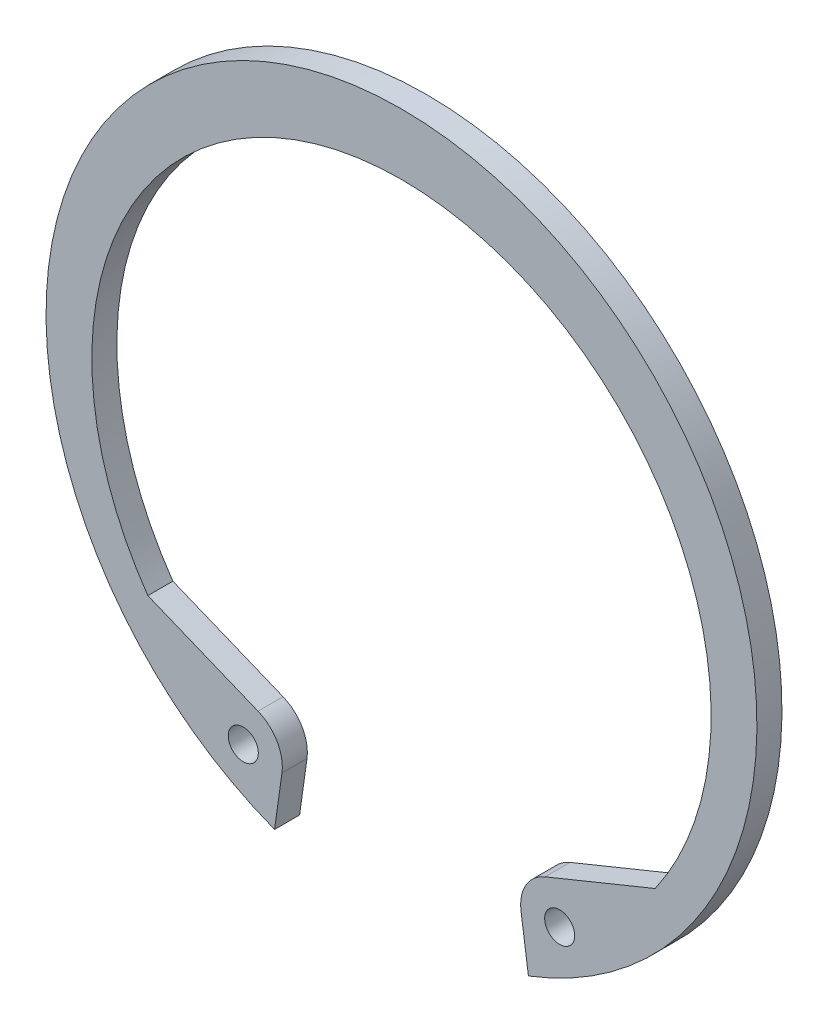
ISO-10303-21;
HEADER;
FILE_DESCRIPTION(('STEP AP214'),'2;1');
FILE_NAME('part.step','',(''),(''),'','','');
FILE_SCHEMA(('AUTOMOTIVE_DESIGN { 1 0 10303 214 1 1 1 1 }'));
ENDSEC;
DATA;
#1=APPLICATION_CONTEXT('core data for automotive mechanical design processes');
#2=APPLICATION_PROTOCOL_DEFINITION('international standard','automotive_design',2000,#1);
#3=PRODUCT_CONTEXT('',#1,'mechanical');
#4=PRODUCT('Part','Part','',(#3));
#5=PRODUCT_RELATED_PRODUCT_CATEGORY('part','',(#4));
#6=PRODUCT_DEFINITION_FORMATION('','',#4);
#7=PRODUCT_DEFINITION_CONTEXT('part definition',#1,'design');
#8=PRODUCT_DEFINITION('design','',#6,#7);
#9=PRODUCT_DEFINITION_SHAPE('','',#8);
#10=(LENGTH_UNIT() NAMED_UNIT(*) SI_UNIT(.MILLI.,.METRE.));
#11=(NAMED_UNIT(*) PLANE_ANGLE_UNIT() SI_UNIT($,.RADIAN.));
#12=(NAMED_UNIT(*) SI_UNIT($,.STERADIAN.) SOLID_ANGLE_UNIT());
#13=UNCERTAINTY_MEASURE_WITH_UNIT(LENGTH_MEASURE(1.E-05),#10,'distance_accuracy_value','');
#14=(GEOMETRIC_REPRESENTATION_CONTEXT(3) GLOBAL_UNCERTAINTY_ASSIGNED_CONTEXT((#13)) GLOBAL_UNIT_ASSIGNED_CONTEXT((#10,
#11,#12)) REPRESENTATION_CONTEXT('',''));
#15=CARTESIAN_POINT('',(0.,0.,0.));
#16=DIRECTION('',(0.,0.,1.));
#17=DIRECTION('',(1.,0.,0.));
#18=AXIS2_PLACEMENT_3D('',#15,#16,#17);
#19=CARTESIAN_POINT('',(-14.3260695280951,-23.7556509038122,2.5));
#20=DIRECTION('',(-0.37793089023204,-0.925833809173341,0.));
#21=DIRECTION('',(0.925833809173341,-0.37793089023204,0.));
#22=AXIS2_PLACEMENT_3D('',#19,#20,#21);
#23=PLANE('',#22);
#24=DIRECTION('',(-0.925833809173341,0.37793089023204,0.));
#25=VECTOR('',#24,1.);
#26=CARTESIAN_POINT('',(-14.3260695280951,-23.7556509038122,0.));
#27=LINE('',#26,#25);
#28=CARTESIAN_POINT('',(-14.3260695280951,-23.7556509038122,0.));
#29=VERTEX_POINT('',#28);
#30=CARTESIAN_POINT('',(-25.3322769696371,-19.2628512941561,0.));
#31=VERTEX_POINT('',#30);
#32=EDGE_CURVE('E111',#29,#31,#27,.T.);
#33=ORIENTED_EDGE('',*,*,#32,.T.);
#34=DIRECTION('',(0.,0.,-1.));
#35=VECTOR('',#34,1.);
#36=CARTESIAN_POINT('',(-25.3322769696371,-19.2628512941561,2.5));
#37=LINE('',#36,#35);
#38=CARTESIAN_POINT('',(-25.3322769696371,-19.2628512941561,2.5));
#39=VERTEX_POINT('',#38);
#40=EDGE_CURVE('E11',#39,#31,#37,.T.);
#41=ORIENTED_EDGE('',*,*,#40,.F.);
#42=DIRECTION('',(-0.925833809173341,0.37793089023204,0.));
#43=VECTOR('',#42,1.);
#44=CARTESIAN_POINT('',(-14.3260695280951,-23.7556509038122,2.5));
#45=LINE('',#44,#43);
#46=CARTESIAN_POINT('',(-14.3260695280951,-23.7556509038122,2.5));
#47=VERTEX_POINT('',#46);
#48=EDGE_CURVE('E131',#47,#39,#45,.T.);
#49=ORIENTED_EDGE('',*,*,#48,.F.);
#50=DIRECTION('',(0.,0.,-1.));
#51=VECTOR('',#50,1.);
#52=CARTESIAN_POINT('',(-14.3260695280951,-23.7556509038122,2.5));
#53=LINE('',#52,#51);
#54=EDGE_CURVE('E146',#47,#29,#53,.T.);
#55=ORIENTED_EDGE('',*,*,#54,.T.);
#56=EDGE_LOOP('',(#33,#41,#49,#55));
#57=FACE_BOUND('',#56,.T.);
#58=ADVANCED_FACE('F30',(#57),#23,.F.);
#59=CARTESIAN_POINT('',(0.,-1.525,2.5));
#60=DIRECTION('',(0.,0.,-1.));
#61=DIRECTION('',(-1.,0.,0.));
#62=AXIS2_PLACEMENT_3D('',#59,#60,#61);
#63=CYLINDRICAL_SURFACE('',#62,30.925);
#64=CARTESIAN_POINT('',(0.,-1.525,0.));
#65=DIRECTION('',(0.,0.,1.));
#66=DIRECTION('',(1.,0.,0.));
#67=AXIS2_PLACEMENT_3D('',#64,#65,#66);
#68=CIRCLE('',#67,30.925);
#69=CARTESIAN_POINT('',(25.3322769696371,-19.2628512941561,0.));
#70=VERTEX_POINT('',#69);
#71=EDGE_CURVE('E105',#70,#31,#68,.T.);
#72=ORIENTED_EDGE('',*,*,#71,.F.);
#73=DIRECTION('',(0.,0.,-1.));
#74=VECTOR('',#73,1.);
#75=CARTESIAN_POINT('',(25.3322769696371,-19.2628512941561,2.5));
#76=LINE('',#75,#74);
#77=CARTESIAN_POINT('',(25.3322769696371,-19.2628512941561,2.5));
#78=VERTEX_POINT('',#77);
#79=EDGE_CURVE('E33',#78,#70,#76,.T.);
#80=ORIENTED_EDGE('',*,*,#79,.F.);
#81=CARTESIAN_POINT('',(0.,-1.525,2.5));
#82=DIRECTION('',(0.,0.,1.));
#83=DIRECTION('',(1.,0.,0.));
#84=AXIS2_PLACEMENT_3D('',#81,#82,#83);
#85=CIRCLE('',#84,30.925);
#86=EDGE_CURVE('E134',#78,#39,#85,.T.);
#87=ORIENTED_EDGE('',*,*,#86,.T.);
#88=ORIENTED_EDGE('',*,*,#40,.T.);
#89=EDGE_LOOP('',(#72,#80,#87,#88));
#90=FACE_BOUND('',#89,.T.);
#91=ADVANCED_FACE('F106',(#90),#63,.F.);
#92=CARTESIAN_POINT('',(14.326069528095,-23.7556509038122,2.5));
#93=DIRECTION('',(-0.377930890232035,0.925833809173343,0.));
#94=DIRECTION('',(-0.925833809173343,-0.377930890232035,0.));
#95=AXIS2_PLACEMENT_3D('',#92,#93,#94);
#96=PLANE('',#95);
#97=DIRECTION('',(0.925833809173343,0.377930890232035,0.));
#98=VECTOR('',#97,1.);
#99=CARTESIAN_POINT('',(14.326069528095,-23.7556509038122,0.));
#100=LINE('',#99,#98);
#101=CARTESIAN_POINT('',(14.326069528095,-23.7556509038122,0.));
#102=VERTEX_POINT('',#101);
#103=EDGE_CURVE('E97',#102,#70,#100,.T.);
#104=ORIENTED_EDGE('',*,*,#103,.F.);
#105=DIRECTION('',(0.,0.,-1.));
#106=VECTOR('',#105,1.);
#107=CARTESIAN_POINT('',(14.326069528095,-23.7556509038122,2.5));
#108=LINE('',#107,#106);
#109=CARTESIAN_POINT('',(14.326069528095,-23.7556509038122,2.5));
#110=VERTEX_POINT('',#109);
#111=EDGE_CURVE('E103',#110,#102,#108,.T.);
#112=ORIENTED_EDGE('',*,*,#111,.F.);
#113=DIRECTION('',(0.925833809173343,0.377930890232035,0.));
#114=VECTOR('',#113,1.);
#115=CARTESIAN_POINT('',(14.326069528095,-23.7556509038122,2.5));
#116=LINE('',#115,#114);
#117=EDGE_CURVE('E99',#110,#78,#116,.T.);
#118=ORIENTED_EDGE('',*,*,#117,.T.);
#119=ORIENTED_EDGE('',*,*,#79,.T.);
#120=EDGE_LOOP('',(#104,#112,#118,#119));
#121=FACE_BOUND('',#120,.T.);
#122=ADVANCED_FACE('F95',(#121),#96,.T.);
#123=CARTESIAN_POINT('',(15.8,-27.3664027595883,2.5));
#124=DIRECTION('',(0.,0.,-1.));
#125=DIRECTION('',(-1.,0.,0.));
#126=AXIS2_PLACEMENT_3D('',#123,#124,#125);
#127=CYLINDRICAL_SURFACE('',#126,3.9);
#128=CARTESIAN_POINT('',(15.8,-27.3664027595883,0.));
#129=DIRECTION('',(0.,0.,1.));
#130=DIRECTION('',(1.,0.,0.));
#131=AXIS2_PLACEMENT_3D('',#128,#129,#130);
#132=CIRCLE('',#131,3.9);
#133=CARTESIAN_POINT('',(11.9379545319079,-27.9091778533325,0.));
#134=VERTEX_POINT('',#133);
#135=EDGE_CURVE('E116',#102,#134,#132,.T.);
#136=ORIENTED_EDGE('',*,*,#135,.T.);
#137=DIRECTION('',(0.,0.,-1.));
#138=VECTOR('',#137,1.);
#139=CARTESIAN_POINT('',(11.9379545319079,-27.9091778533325,2.5));
#140=LINE('',#139,#138);
#141=CARTESIAN_POINT('',(11.9379545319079,-27.9091778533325,2.5));
#142=VERTEX_POINT('',#141);
#143=EDGE_CURVE('E156',#142,#134,#140,.T.);
#144=ORIENTED_EDGE('',*,*,#143,.F.);
#145=CARTESIAN_POINT('',(15.8,-27.3664027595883,2.5));
#146=DIRECTION('',(0.,0.,1.));
#147=DIRECTION('',(1.,0.,0.));
#148=AXIS2_PLACEMENT_3D('',#145,#146,#147);
#149=CIRCLE('',#148,3.9);
#150=EDGE_CURVE('E137',#110,#142,#149,.T.);
#151=ORIENTED_EDGE('',*,*,#150,.F.);
#152=ORIENTED_EDGE('',*,*,#111,.T.);
#153=EDGE_LOOP('',(#136,#144,#151,#152));
#154=FACE_BOUND('',#153,.T.);
#155=ADVANCED_FACE('F161',(#154),#127,.T.);
#156=CARTESIAN_POINT('',(11.9379545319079,-27.9091778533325,2.5));
#157=DIRECTION('',(0.990268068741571,0.139173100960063,0.));
#158=DIRECTION('',(-0.139173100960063,0.990268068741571,0.));
#159=AXIS2_PLACEMENT_3D('',#156,#157,#158);
#160=PLANE('',#159);
#161=DIRECTION('',(0.139173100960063,-0.990268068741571,0.));
#162=VECTOR('',#161,1.);
#163=CARTESIAN_POINT('',(11.9379545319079,-27.9091778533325,0.));
#164=LINE('',#163,#162);
#165=CARTESIAN_POINT('',(12.6758807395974,-33.1597956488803,0.));
#166=VERTEX_POINT('',#165);
#167=EDGE_CURVE('E118',#134,#166,#164,.T.);
#168=ORIENTED_EDGE('',*,*,#167,.T.);
#169=DIRECTION('',(0.,0.,-1.));
#170=VECTOR('',#169,1.);
#171=CARTESIAN_POINT('',(12.6758807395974,-33.1597956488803,2.5));
#172=LINE('',#171,#170);
#173=CARTESIAN_POINT('',(12.6758807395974,-33.1597956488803,2.5));
#174=VERTEX_POINT('',#173);
#175=EDGE_CURVE('E153',#174,#166,#172,.T.);
#176=ORIENTED_EDGE('',*,*,#175,.F.);
#177=DIRECTION('',(0.139173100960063,-0.990268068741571,0.));
#178=VECTOR('',#177,1.);
#179=CARTESIAN_POINT('',(11.9379545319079,-27.9091778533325,2.5));
#180=LINE('',#179,#178);
#181=EDGE_CURVE('E139',#142,#174,#180,.T.);
#182=ORIENTED_EDGE('',*,*,#181,.F.);
#183=ORIENTED_EDGE('',*,*,#143,.T.);
#184=EDGE_LOOP('',(#168,#176,#182,#183));
#185=FACE_BOUND('',#184,.T.);
#186=ADVANCED_FACE('F177',(#185),#160,.F.);
#187=CARTESIAN_POINT('',(0.,0.,2.5));
#188=DIRECTION('',(0.,0.,-1.));
#189=DIRECTION('',(-1.,0.,0.));
#190=AXIS2_PLACEMENT_3D('',#187,#188,#189);
#191=CYLINDRICAL_SURFACE('',#190,35.5);
#192=CARTESIAN_POINT('',(0.,0.,0.));
#193=DIRECTION('',(0.,0.,1.));
#194=DIRECTION('',(1.,0.,0.));
#195=AXIS2_PLACEMENT_3D('',#192,#193,#194);
#196=CIRCLE('',#195,35.5);
#197=CARTESIAN_POINT('',(-12.6758807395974,-33.1597956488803,0.));
#198=VERTEX_POINT('',#197);
#199=EDGE_CURVE('E123',#166,#198,#196,.T.);
#200=ORIENTED_EDGE('',*,*,#199,.T.);
#201=DIRECTION('',(0.,0.,-1.));
#202=VECTOR('',#201,1.);
#203=CARTESIAN_POINT('',(-12.6758807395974,-33.1597956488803,2.5));
#204=LINE('',#203,#202);
#205=CARTESIAN_POINT('',(-12.6758807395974,-33.1597956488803,2.5));
#206=VERTEX_POINT('',#205);
#207=EDGE_CURVE('E151',#206,#198,#204,.T.);
#208=ORIENTED_EDGE('',*,*,#207,.F.);
#209=CARTESIAN_POINT('',(0.,0.,2.5));
#210=DIRECTION('',(0.,0.,1.));
#211=DIRECTION('',(1.,0.,0.));
#212=AXIS2_PLACEMENT_3D('',#209,#210,#211);
#213=CIRCLE('',#212,35.5);
#214=EDGE_CURVE('E141',#174,#206,#213,.T.);
#215=ORIENTED_EDGE('',*,*,#214,.F.);
#216=ORIENTED_EDGE('',*,*,#175,.T.);
#217=EDGE_LOOP('',(#200,#208,#215,#216));
#218=FACE_BOUND('',#217,.T.);
#219=ADVANCED_FACE('F174',(#218),#191,.T.);
#220=CARTESIAN_POINT('',(-11.9379545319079,-27.9091778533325,2.5));
#221=DIRECTION('',(0.99026806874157,-0.139173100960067,0.));
#222=DIRECTION('',(0.139173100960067,0.99026806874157,0.));
#223=AXIS2_PLACEMENT_3D('',#220,#221,#222);
#224=PLANE('',#223);
#225=DIRECTION('',(-0.139173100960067,-0.99026806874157,0.));
#226=VECTOR('',#225,1.);
#227=CARTESIAN_POINT('',(-11.9379545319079,-27.9091778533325,0.));
#228=LINE('',#227,#226);
#229=CARTESIAN_POINT('',(-11.9379545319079,-27.9091778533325,0.));
#230=VERTEX_POINT('',#229);
#231=EDGE_CURVE('E126',#230,#198,#228,.T.);
#232=ORIENTED_EDGE('',*,*,#231,.F.);
#233=DIRECTION('',(0.,0.,-1.));
#234=VECTOR('',#233,1.);
#235=CARTESIAN_POINT('',(-11.9379545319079,-27.9091778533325,2.5));
#236=LINE('',#235,#234);
#237=CARTESIAN_POINT('',(-11.9379545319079,-27.9091778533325,2.5));
#238=VERTEX_POINT('',#237);
#239=EDGE_CURVE('E52',#238,#230,#236,.T.);
#240=ORIENTED_EDGE('',*,*,#239,.F.);
#241=DIRECTION('',(-0.139173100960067,-0.99026806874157,0.));
#242=VECTOR('',#241,1.);
#243=CARTESIAN_POINT('',(-11.9379545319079,-27.9091778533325,2.5));
#244=LINE('',#243,#242);
#245=EDGE_CURVE('E143',#238,#206,#244,.T.);
#246=ORIENTED_EDGE('',*,*,#245,.T.);
#247=ORIENTED_EDGE('',*,*,#207,.T.);
#248=EDGE_LOOP('',(#232,#240,#246,#247));
#249=FACE_BOUND('',#248,.T.);
#250=ADVANCED_FACE('F170',(#249),#224,.T.);
#251=CARTESIAN_POINT('',(-15.8,-27.3664027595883,2.5));
#252=DIRECTION('',(0.,0.,-1.));
#253=DIRECTION('',(-1.,0.,0.));
#254=AXIS2_PLACEMENT_3D('',#251,#252,#253);
#255=CYLINDRICAL_SURFACE('',#254,3.9);
#256=CARTESIAN_POINT('',(-15.8,-27.3664027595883,0.));
#257=DIRECTION('',(0.,0.,1.));
#258=DIRECTION('',(1.,0.,0.));
#259=AXIS2_PLACEMENT_3D('',#256,#257,#258);
#260=CIRCLE('',#259,3.9);
#261=EDGE_CURVE('E129',#230,#29,#260,.T.);
#262=ORIENTED_EDGE('',*,*,#261,.T.);
#263=ORIENTED_EDGE('',*,*,#54,.F.);
#264=CARTESIAN_POINT('',(-15.8,-27.3664027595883,2.5));
#265=DIRECTION('',(0.,0.,1.));
#266=DIRECTION('',(1.,0.,0.));
#267=AXIS2_PLACEMENT_3D('',#264,#265,#266);
#268=CIRCLE('',#267,3.9);
#269=EDGE_CURVE('E44',#238,#47,#268,.T.);
#270=ORIENTED_EDGE('',*,*,#269,.F.);
#271=ORIENTED_EDGE('',*,*,#239,.T.);
#272=EDGE_LOOP('',(#262,#263,#270,#271));
#273=FACE_BOUND('',#272,.T.);
#274=ADVANCED_FACE('F213',(#273),#255,.T.);
#275=CARTESIAN_POINT('',(0.,-1.525,2.5));
#276=DIRECTION('',(0.,0.,1.));
#277=DIRECTION('',(1.,0.,0.));
#278=AXIS2_PLACEMENT_3D('',#275,#276,#277);
#279=PLANE('',#278);
#280=CARTESIAN_POINT('',(15.8,-27.3664027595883,2.5));
#281=DIRECTION('',(0.,0.,-1.));
#282=DIRECTION('',(0.,1.,0.));
#283=AXIS2_PLACEMENT_3D('',#280,#281,#282);
#284=CIRCLE('',#283,1.5);
#285=CARTESIAN_POINT('',(15.8,-25.8664027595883,2.5));
#286=VERTEX_POINT('',#285);
#287=EDGE_CURVE('E254',#286,#286,#284,.T.);
#288=ORIENTED_EDGE('',*,*,#287,.T.);
#289=EDGE_LOOP('',(#288));
#290=FACE_BOUND('',#289,.T.);
#291=CARTESIAN_POINT('',(-15.8,-27.3664027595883,2.5));
#292=DIRECTION('',(0.,0.,-1.));
#293=DIRECTION('',(0.,1.,0.));
#294=AXIS2_PLACEMENT_3D('',#291,#292,#293);
#295=CIRCLE('',#294,1.5);
#296=CARTESIAN_POINT('',(-15.8,-25.8664027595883,2.5));
#297=VERTEX_POINT('',#296);
#298=EDGE_CURVE('E133',#297,#297,#295,.T.);
#299=ORIENTED_EDGE('',*,*,#298,.T.);
#300=EDGE_LOOP('',(#299));
#301=FACE_BOUND('',#300,.T.);
#302=ORIENTED_EDGE('',*,*,#48,.T.);
#303=ORIENTED_EDGE('',*,*,#86,.F.);
#304=ORIENTED_EDGE('',*,*,#117,.F.);
#305=ORIENTED_EDGE('',*,*,#150,.T.);
#306=ORIENTED_EDGE('',*,*,#181,.T.);
#307=ORIENTED_EDGE('',*,*,#214,.T.);
#308=ORIENTED_EDGE('',*,*,#245,.F.);
#309=ORIENTED_EDGE('',*,*,#269,.T.);
#310=EDGE_LOOP('',(#302,#303,#304,#305,#306,#307,#308,#309));
#311=FACE_BOUND('',#310,.T.);
#312=ADVANCED_FACE('F164',(#290,#301,#311),#279,.T.);
#313=CARTESIAN_POINT('',(0.,-1.525,0.));
#314=DIRECTION('',(0.,0.,1.));
#315=DIRECTION('',(1.,0.,0.));
#316=AXIS2_PLACEMENT_3D('',#313,#314,#315);
#317=PLANE('',#316);
#318=CARTESIAN_POINT('',(15.8,-27.3664027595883,0.));
#319=DIRECTION('',(0.,0.,1.));
#320=DIRECTION('',(0.,1.,0.));
#321=AXIS2_PLACEMENT_3D('',#318,#319,#320);
#322=CIRCLE('',#321,1.5);
#323=CARTESIAN_POINT('',(15.8,-25.8664027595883,0.));
#324=VERTEX_POINT('',#323);
#325=EDGE_CURVE('E257',#324,#324,#322,.T.);
#326=ORIENTED_EDGE('',*,*,#325,.T.);
#327=EDGE_LOOP('',(#326));
#328=FACE_BOUND('',#327,.T.);
#329=CARTESIAN_POINT('',(-15.8,-27.3664027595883,0.));
#330=DIRECTION('',(0.,0.,1.));
#331=DIRECTION('',(0.,1.,0.));
#332=AXIS2_PLACEMENT_3D('',#329,#330,#331);
#333=CIRCLE('',#332,1.5);
#334=CARTESIAN_POINT('',(-15.8,-25.8664027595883,0.));
#335=VERTEX_POINT('',#334);
#336=EDGE_CURVE('E259',#335,#335,#333,.T.);
#337=ORIENTED_EDGE('',*,*,#336,.T.);
#338=EDGE_LOOP('',(#337));
#339=FACE_BOUND('',#338,.T.);
#340=ORIENTED_EDGE('',*,*,#32,.F.);
#341=ORIENTED_EDGE('',*,*,#261,.F.);
#342=ORIENTED_EDGE('',*,*,#231,.T.);
#343=ORIENTED_EDGE('',*,*,#199,.F.);
#344=ORIENTED_EDGE('',*,*,#167,.F.);
#345=ORIENTED_EDGE('',*,*,#135,.F.);
#346=ORIENTED_EDGE('',*,*,#103,.T.);
#347=ORIENTED_EDGE('',*,*,#71,.T.);
#348=EDGE_LOOP('',(#340,#341,#342,#343,#344,#345,#346,#347));
#349=FACE_BOUND('',#348,.T.);
#350=ADVANCED_FACE('F114',(#328,#339,#349),#317,.F.);
#351=CARTESIAN_POINT('',(-15.8,-27.3664027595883,0.));
#352=DIRECTION('',(0.,0.,1.));
#353=DIRECTION('',(0.,1.,0.));
#354=AXIS2_PLACEMENT_3D('',#351,#352,#353);
#355=CYLINDRICAL_SURFACE('',#354,1.5);
#356=ORIENTED_EDGE('',*,*,#298,.F.);
#357=EDGE_LOOP('',(#356));
#358=FACE_BOUND('',#357,.T.);
#359=ORIENTED_EDGE('',*,*,#336,.F.);
#360=EDGE_LOOP('',(#359));
#361=FACE_BOUND('',#360,.T.);
#362=ADVANCED_FACE('F233',(#358,#361),#355,.F.);
#363=CARTESIAN_POINT('',(15.8,-27.3664027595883,0.));
#364=DIRECTION('',(0.,0.,1.));
#365=DIRECTION('',(0.,1.,0.));
#366=AXIS2_PLACEMENT_3D('',#363,#364,#365);
#367=CYLINDRICAL_SURFACE('',#366,1.5);
#368=ORIENTED_EDGE('',*,*,#287,.F.);
#369=EDGE_LOOP('',(#368));
#370=FACE_BOUND('',#369,.T.);
#371=ORIENTED_EDGE('',*,*,#325,.F.);
#372=EDGE_LOOP('',(#371));
#373=FACE_BOUND('',#372,.T.);
#374=ADVANCED_FACE('F241',(#370,#373),#367,.F.);
#375=CLOSED_SHELL('',(#58,#91,#122,#155,#186,#219,#250,#274,#312,#350,#362,#374));
#376=MANIFOLD_SOLID_BREP('B2',#375);
#377=ADVANCED_BREP_SHAPE_REPRESENTATION('',(#18,#376),#14);
#378=SHAPE_DEFINITION_REPRESENTATION(#9,#377);
ENDSEC;
END-ISO-10303-21;
